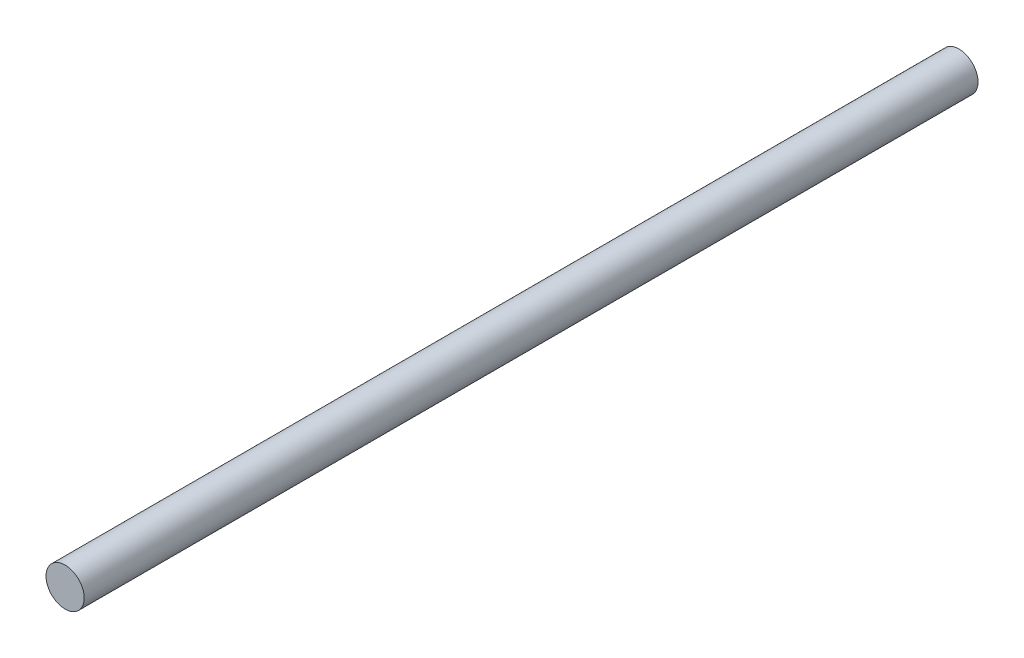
ISO-10303-21;
HEADER;
FILE_DESCRIPTION(('STEP AP214'),'2;1');
FILE_NAME('part.step','',(''),(''),'','','');
FILE_SCHEMA(('AUTOMOTIVE_DESIGN { 1 0 10303 214 1 1 1 1 }'));
ENDSEC;
DATA;
#1=APPLICATION_CONTEXT('core data for automotive mechanical design processes');
#2=APPLICATION_PROTOCOL_DEFINITION('international standard','automotive_design',2000,#1);
#3=PRODUCT_CONTEXT('',#1,'mechanical');
#4=PRODUCT('Part','Part','',(#3));
#5=PRODUCT_RELATED_PRODUCT_CATEGORY('part','',(#4));
#6=PRODUCT_DEFINITION_FORMATION('','',#4);
#7=PRODUCT_DEFINITION_CONTEXT('part definition',#1,'design');
#8=PRODUCT_DEFINITION('design','',#6,#7);
#9=PRODUCT_DEFINITION_SHAPE('','',#8);
#10=(LENGTH_UNIT() NAMED_UNIT(*) SI_UNIT(.MILLI.,.METRE.));
#11=(NAMED_UNIT(*) PLANE_ANGLE_UNIT() SI_UNIT($,.RADIAN.));
#12=(NAMED_UNIT(*) SI_UNIT($,.STERADIAN.) SOLID_ANGLE_UNIT());
#13=UNCERTAINTY_MEASURE_WITH_UNIT(LENGTH_MEASURE(1.E-05),#10,'distance_accuracy_value','');
#14=(GEOMETRIC_REPRESENTATION_CONTEXT(3) GLOBAL_UNCERTAINTY_ASSIGNED_CONTEXT((#13)) GLOBAL_UNIT_ASSIGNED_CONTEXT((#10,
#11,#12)) REPRESENTATION_CONTEXT('',''));
#15=CARTESIAN_POINT('',(0.,0.,0.));
#16=DIRECTION('',(0.,0.,1.));
#17=DIRECTION('',(1.,0.,0.));
#18=AXIS2_PLACEMENT_3D('',#15,#16,#17);
#19=CARTESIAN_POINT('',(0.,0.,38.1));
#20=DIRECTION('',(0.,0.,-1.));
#21=DIRECTION('',(-1.,0.,0.));
#22=AXIS2_PLACEMENT_3D('',#19,#20,#21);
#23=CYLINDRICAL_SURFACE('',#22,0.81407);
#24=CARTESIAN_POINT('',(0.,0.,38.1));
#25=DIRECTION('',(0.,0.,1.));
#26=DIRECTION('',(1.,0.,0.));
#27=AXIS2_PLACEMENT_3D('',#24,#25,#26);
#28=CIRCLE('',#27,0.81407);
#29=CARTESIAN_POINT('',(-0.81407,0.,38.1));
#30=VERTEX_POINT('',#29);
#31=EDGE_CURVE('E10',#30,#30,#28,.T.);
#32=CARTESIAN_POINT('',(0.,0.,0.));
#33=DIRECTION('',(0.,0.,1.));
#34=DIRECTION('',(1.,0.,0.));
#35=AXIS2_PLACEMENT_3D('',#32,#33,#34);
#36=CIRCLE('',#35,0.81407);
#37=CARTESIAN_POINT('',(-0.81407,0.,0.));
#38=VERTEX_POINT('',#37);
#39=EDGE_CURVE('E35',#38,#38,#36,.T.);
#40=CARTESIAN_POINT('',(-0.81407,0.,38.1));
#41=CARTESIAN_POINT('',(-0.81407,0.,37.703125));
#42=CARTESIAN_POINT('',(-0.81407,0.,37.30625));
#43=CARTESIAN_POINT('',(-0.81407,0.,36.5125));
#44=CARTESIAN_POINT('',(-0.81407,0.,36.115625));
#45=CARTESIAN_POINT('',(-0.81407,0.,35.321875));
#46=CARTESIAN_POINT('',(-0.81407,0.,34.925));
#47=CARTESIAN_POINT('',(-0.81407,0.,34.13125));
#48=CARTESIAN_POINT('',(-0.81407,0.,33.734375));
#49=CARTESIAN_POINT('',(-0.81407,0.,32.940625));
#50=CARTESIAN_POINT('',(-0.81407,0.,32.54375));
#51=CARTESIAN_POINT('',(-0.81407,0.,31.75));
#52=CARTESIAN_POINT('',(-0.81407,0.,31.353125));
#53=CARTESIAN_POINT('',(-0.81407,0.,30.559375));
#54=CARTESIAN_POINT('',(-0.81407,0.,30.1625));
#55=CARTESIAN_POINT('',(-0.81407,0.,29.36875));
#56=CARTESIAN_POINT('',(-0.81407,0.,28.971875));
#57=CARTESIAN_POINT('',(-0.81407,0.,28.178125));
#58=CARTESIAN_POINT('',(-0.81407,0.,27.78125));
#59=CARTESIAN_POINT('',(-0.81407,0.,26.9875));
#60=CARTESIAN_POINT('',(-0.81407,0.,26.590625));
#61=CARTESIAN_POINT('',(-0.81407,0.,25.796875));
#62=CARTESIAN_POINT('',(-0.81407,0.,25.4));
#63=CARTESIAN_POINT('',(-0.81407,0.,24.60625));
#64=CARTESIAN_POINT('',(-0.81407,0.,24.209375));
#65=CARTESIAN_POINT('',(-0.81407,0.,23.415625));
#66=CARTESIAN_POINT('',(-0.81407,0.,23.01875));
#67=CARTESIAN_POINT('',(-0.81407,0.,22.225));
#68=CARTESIAN_POINT('',(-0.81407,0.,21.828125));
#69=CARTESIAN_POINT('',(-0.81407,0.,21.034375));
#70=CARTESIAN_POINT('',(-0.81407,0.,20.6375));
#71=CARTESIAN_POINT('',(-0.81407,0.,19.84375));
#72=CARTESIAN_POINT('',(-0.81407,0.,19.446875));
#73=CARTESIAN_POINT('',(-0.81407,0.,18.653125));
#74=CARTESIAN_POINT('',(-0.81407,0.,18.25625));
#75=CARTESIAN_POINT('',(-0.81407,0.,17.4625));
#76=CARTESIAN_POINT('',(-0.81407,0.,17.065625));
#77=CARTESIAN_POINT('',(-0.81407,0.,16.271875));
#78=CARTESIAN_POINT('',(-0.81407,0.,15.875));
#79=CARTESIAN_POINT('',(-0.81407,0.,15.08125));
#80=CARTESIAN_POINT('',(-0.81407,0.,14.684375));
#81=CARTESIAN_POINT('',(-0.81407,0.,13.890625));
#82=CARTESIAN_POINT('',(-0.81407,0.,13.49375));
#83=CARTESIAN_POINT('',(-0.81407,0.,12.7));
#84=CARTESIAN_POINT('',(-0.81407,0.,12.303125));
#85=CARTESIAN_POINT('',(-0.81407,0.,11.509375));
#86=CARTESIAN_POINT('',(-0.81407,0.,11.1125));
#87=CARTESIAN_POINT('',(-0.81407,0.,10.31875));
#88=CARTESIAN_POINT('',(-0.81407,0.,9.92187499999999));
#89=CARTESIAN_POINT('',(-0.81407,0.,9.128125));
#90=CARTESIAN_POINT('',(-0.81407,0.,8.73124999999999));
#91=CARTESIAN_POINT('',(-0.81407,0.,7.93749999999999));
#92=CARTESIAN_POINT('',(-0.81407,0.,7.54062499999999));
#93=CARTESIAN_POINT('',(-0.81407,0.,6.746875));
#94=CARTESIAN_POINT('',(-0.81407,0.,6.35));
#95=CARTESIAN_POINT('',(-0.81407,0.,5.55625));
#96=CARTESIAN_POINT('',(-0.81407,0.,5.159375));
#97=CARTESIAN_POINT('',(-0.81407,0.,4.365625));
#98=CARTESIAN_POINT('',(-0.81407,0.,3.96875));
#99=CARTESIAN_POINT('',(-0.81407,0.,3.175));
#100=CARTESIAN_POINT('',(-0.81407,0.,2.778125));
#101=CARTESIAN_POINT('',(-0.81407,0.,1.984375));
#102=CARTESIAN_POINT('',(-0.81407,0.,1.5875));
#103=CARTESIAN_POINT('',(-0.81407,0.,0.79375));
#104=CARTESIAN_POINT('',(-0.81407,0.,0.396875));
#105=CARTESIAN_POINT('',(-0.81407,0.,0.));
#106=B_SPLINE_CURVE_WITH_KNOTS('',3,(#40,#41,#42,#43,#44,#45,#46,#47,#48,#49,#50,#51,#52,#53,
#54,#55,#56,#57,#58,#59,#60,#61,#62,#63,#64,#65,#66,#67,#68,#69,#70,#71,#72,#73,#74,#75,#76,#77,
#78,#79,#80,#81,#82,#83,#84,#85,#86,#87,#88,#89,#90,#91,#92,#93,#94,#95,#96,#97,#98,#99,#100,
#101,#102,#103,#104,#105),.UNSPECIFIED.,.F.,.F.,(4,2,2,2,2,2,2,2,2,2,2,2,2,2,2,2,2,2,2,2,2,2,2,
2,2,2,2,2,2,2,2,2,4),(0.,1.190625,2.38125,3.571875,4.7625,5.953125,7.14375,8.334375,
9.52500000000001,10.715625,11.90625,13.096875,14.2875,15.478125,16.66875,17.859375,19.05,
20.240625,21.43125,22.621875,23.8125,25.003125,26.19375,27.384375,28.575,29.765625,30.95625,
32.146875,33.3375,34.528125,35.71875,36.909375,38.1),.UNSPECIFIED.);
#107=EDGE_CURVE('BSEAM32',#30,#38,#106,.T.);
#108=ORIENTED_EDGE('',*,*,#31,.F.);
#109=ORIENTED_EDGE('',*,*,#39,.T.);
#110=ORIENTED_EDGE('',*,*,#107,.T.);
#111=ORIENTED_EDGE('',*,*,#107,.F.);
#112=EDGE_LOOP('',(#108,#110,#109,#111));
#113=FACE_BOUND('',#112,.T.);
#114=ADVANCED_FACE('F32',(#113),#23,.T.);
#115=CARTESIAN_POINT('',(0.,0.,38.1));
#116=DIRECTION('',(0.,0.,1.));
#117=DIRECTION('',(1.,0.,0.));
#118=AXIS2_PLACEMENT_3D('',#115,#116,#117);
#119=PLANE('',#118);
#120=ORIENTED_EDGE('',*,*,#31,.T.);
#121=EDGE_LOOP('',(#120));
#122=FACE_BOUND('',#121,.T.);
#123=ADVANCED_FACE('F47',(#122),#119,.T.);
#124=CARTESIAN_POINT('',(0.,0.,0.));
#125=DIRECTION('',(0.,0.,1.));
#126=DIRECTION('',(1.,0.,0.));
#127=AXIS2_PLACEMENT_3D('',#124,#125,#126);
#128=PLANE('',#127);
#129=ORIENTED_EDGE('',*,*,#39,.F.);
#130=EDGE_LOOP('',(#129));
#131=FACE_BOUND('',#130,.T.);
#132=ADVANCED_FACE('F45',(#131),#128,.F.);
#133=CLOSED_SHELL('',(#114,#123,#132));
#134=MANIFOLD_SOLID_BREP('B2',#133);
#135=ADVANCED_BREP_SHAPE_REPRESENTATION('',(#18,#134),#14);
#136=SHAPE_DEFINITION_REPRESENTATION(#9,#135);
ENDSEC;
END-ISO-10303-21;
